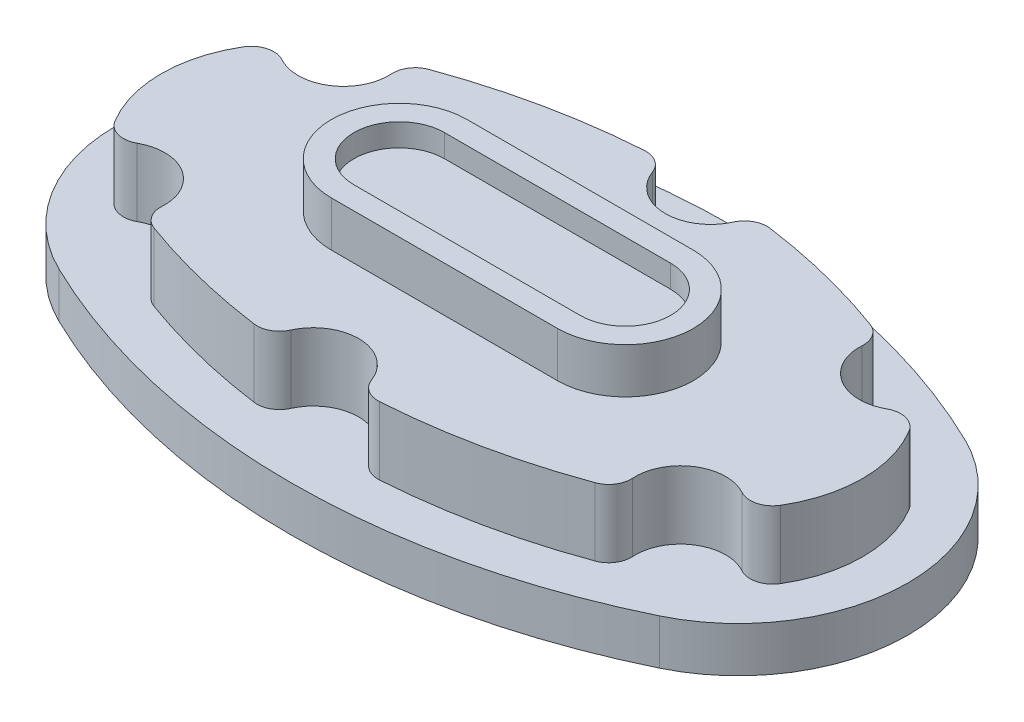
from build123d import *

# Parameters (mm, degrees)
BOSS_EXTRUDE1_DEPTH      = 10
BOSS_EXTRUDE1_DEPTH_BACK = 10
BOSS_EXTRUDE2_DEPTH      = 30
BOSS_EXTRUDE3_DEPTH      = 20
CUT_EXTRUDE1_DEPTH       = 10
BOSS_EXTRUDE4_DEPTH      = 15
FILLET1_R                = 10


with BuildPart() as part:
    # Sketch1 → Boss-Extrude1 (new, two sides: drawn at the far end of the back side and taken through both)
    with BuildSketch(Plane(origin=(0, 0, 0), x_dir=(1, 0, 0), z_dir=(0, 1, 0)).offset(-BOSS_EXTRUDE1_DEPTH_BACK)):
        with BuildLine():
            ThreePointArc((-132.863024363, 67.482314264), (-175.134790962, 0), (-132.863024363, -67.482314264))
            ThreePointArc((-132.863024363, -67.482314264), (-0.134790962, -97.970032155), (132.59344244, -67.482314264))
            ThreePointArc((132.59344244, -67.482314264), (174.865209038, 0), (132.59344244, 67.482314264))
            ThreePointArc((132.59344244, 67.482314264), (-0.134790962, 97.970032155), (-132.863024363, 67.482314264))
        make_face()
    extrude(amount=BOSS_EXTRUDE1_DEPTH + BOSS_EXTRUDE1_DEPTH_BACK)

    # Sketch2 → Boss-Extrude2 (add)
    with BuildSketch(Plane(origin=(0, 10, 0), x_dir=(1, 0, 0), z_dir=(0, 1, 0))):
        with BuildLine():
            ThreePointArc((-105.844223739, -57.575873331), (-114.104560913, -32.184419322), (-140.24401342, -37.633100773))
            ThreePointArc((-140.24401342, -37.633100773), (-155.134790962, 0), (-140.24401342, 37.633100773))
            ThreePointArc((-140.24401342, 37.633100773), (-114.104560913, 32.184419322), (-105.844223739, 57.575873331))
            ThreePointArc((-105.844223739, 57.575873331), (-58.866056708, 71.834389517), (-10.134790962, 77.794020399))
            ThreePointArc((-10.134790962, 77.794020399), (9.161380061, 57.806408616), (29.815671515, 76.387234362))
            ThreePointArc((29.815671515, 76.387234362), (68.344173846, 69.595339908), (105.574641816, 57.575873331))
            ThreePointArc((105.574641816, 57.575873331), (113.83497899, 32.184419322), (139.974431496, 37.633100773))
            ThreePointArc((139.974431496, 37.633100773), (154.865209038, 0), (139.974431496, -37.633100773))
            ThreePointArc((139.974431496, -37.633100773), (113.83497899, -32.184419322), (105.574641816, -57.575873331))
            ThreePointArc((105.574641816, -57.575873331), (58.596474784, -71.834389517), (9.865209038, -77.794020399))
            ThreePointArc((9.865209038, -77.794020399), (-9.430961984, -57.806408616), (-30.085253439, -76.387234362))
            ThreePointArc((-30.085253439, -76.387234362), (-68.613755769, -69.595339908), (-105.844223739, -57.575873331))
        make_face()
    extrude(amount=BOSS_EXTRUDE2_DEPTH)

    # Sketch3 → Boss-Extrude3 (add)
    with BuildSketch(Plane(origin=(0, 40, 0), x_dir=(1, 0, 0), z_dir=(0, 1, 0))):
        with BuildLine():
            Line((-50, 30), (50, 30))
            ThreePointArc((50, 30), (80, 0), (50, -30))
            Line((50, -30), (-50, -30))
            ThreePointArc((-50, -30), (-80, 0), (-50, 30))
        make_face()
    extrude(amount=BOSS_EXTRUDE3_DEPTH)

    # Sketch4 → Cut-Extrude1 (cut)
    with BuildSketch(Plane(origin=(0, 60, 0), x_dir=(1, 0, 0), z_dir=(0, 1, 0))):
        with BuildLine():
            Line((-50, -20), (50, -20))
            ThreePointArc((50, -20), (70, 0), (50, 20))
            Line((50, 20), (-50, 20))
            ThreePointArc((-50, 20), (-70, 0), (-50, -20))
        make_face()
    extrude(amount=-CUT_EXTRUDE1_DEPTH, mode=Mode.SUBTRACT)

    # Sketch5 → Boss-Extrude4 (add)
    with BuildSketch(Plane.XZ.offset(10)):
        with BuildLine():
            ThreePointArc((139.736616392, -30.170695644), (110.906376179, -28.108293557), (99.399123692, -54.622806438))
            ThreePointArc((99.399123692, -54.622806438), (67.139236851, -64.742698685), (33.892547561, -70.888442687))
            ThreePointArc((33.892547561, -70.888442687), (8.985422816, -52.80950567), (-14.588350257, -72.595613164))
            ThreePointArc((-14.588350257, -72.595613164), (-57.83263754, -66.942350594), (-99.668705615, -54.622806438))
            ThreePointArc((-99.668705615, -54.622806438), (-111.175958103, -28.108293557), (-140.006198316, -30.170695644))
            ThreePointArc((-140.006198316, -30.170695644), (-150.134790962, 0), (-140.006198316, 30.170695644))
            ThreePointArc((-140.006198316, 30.170695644), (-111.175958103, 28.108293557), (-99.668705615, 54.622806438))
            ThreePointArc((-99.668705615, 54.622806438), (-67.408818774, 64.742698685), (-34.162129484, 70.888442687))
            ThreePointArc((-34.162129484, 70.888442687), (-9.25500474, 52.80950567), (14.318768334, 72.595613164))
            ThreePointArc((14.318768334, 72.595613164), (57.563055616, 66.942350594), (99.399123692, 54.622806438))
            ThreePointArc((99.399123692, 54.622806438), (110.906376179, 28.108293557), (139.736616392, 30.170695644))
            ThreePointArc((139.736616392, 30.170695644), (149.865209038, 0), (139.736616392, -30.170695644))
        make_face()
    extrude(amount=BOSS_EXTRUDE4_DEPTH)

    # Fillet1
    fillet1_edges = [part.edges().sort_by_distance(p)[0] for p in [
        (29.815671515, 25, -76.387234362),
        (-10.134790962, 25, -77.794020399),
        (-105.844223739, 25, -57.575873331),
        (-140.24401342, 25, -37.633100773),
        (-140.24401342, 25, 37.633100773),
        (-105.844223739, 25, 57.575873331),
        (-30.085253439, 25, 76.387234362),
        (9.865209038, 25, 77.794020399),
        (105.574641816, 25, 57.575873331),
        (139.974431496, 25, 37.633100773),
        (139.974431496, 25, -37.633100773),
        (105.574641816, 25, -57.575873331),
        (139.736616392, -17.5, -30.170695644),
        (139.736616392, -17.5, 30.170695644),
        (99.399123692, -17.5, 54.622806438),
        (14.318768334, -17.5, 72.595613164),
        (-34.162129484, -17.5, 70.888442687),
        (-99.668705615, -17.5, 54.622806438),
        (-140.006198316, -17.5, 30.170695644),
        (-140.006198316, -17.5, -30.170695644),
        (-99.668705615, -17.5, -54.622806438),
        (-14.588350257, -17.5, -72.595613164),
        (33.892547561, -17.5, -70.888442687),
        (99.399123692, -17.5, -54.622806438),
    ]]
    fillet(fillet1_edges, radius=FILLET1_R)


solid = part.part
